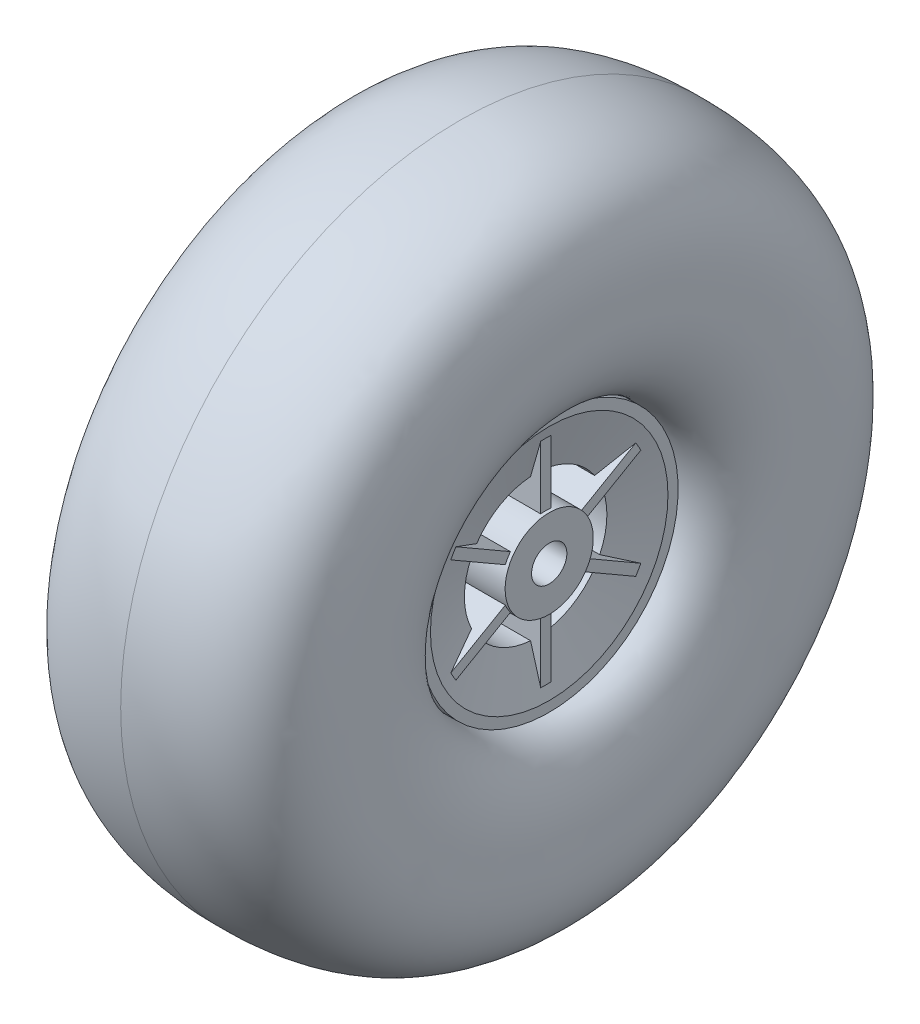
from build123d import *

# Parameters (mm, degrees)
BOSS_EXTRU_1_REACH           = 39.251
ESQUISSE2_W                  = 1.5
ESQUISSE2_H                  = 11.043414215
R_P_TITION_CIRCULAIRE1_COUNT = 6
SYM_TRIE1_COPY_1_REACH       = 39.251
SYM_TRIE1_COPY_1_SKETCH_W    = 1.5
SYM_TRIE1_COPY_1_SKETCH_H    = 11.043414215
SYM_TRIE1_COPY_2_REACH       = 39.251
SYM_TRIE1_COPY_2_SKETCH_W    = 1.5
SYM_TRIE1_COPY_2_SKETCH_H    = 11.043414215
SYM_TRIE1_COPY_3_REACH       = 39.251
SYM_TRIE1_COPY_3_SKETCH_W    = 1.5
SYM_TRIE1_COPY_3_SKETCH_H    = 11.043414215
SYM_TRIE1_COPY_4_REACH       = 39.251
SYM_TRIE1_COPY_4_SKETCH_W    = 1.5
SYM_TRIE1_COPY_4_SKETCH_H    = 11.043414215
SYM_TRIE1_COPY_5_REACH       = 39.251
SYM_TRIE1_COPY_5_SKETCH_W    = 1.5
SYM_TRIE1_COPY_5_SKETCH_H    = 11.043414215


with BuildPart() as part:
    # Esquisse1 → R_volution1 (revolve)
    with BuildSketch(Plane.XY, mode=Mode.PRIVATE) as r_volution1_sk:
        Polygon((13.15, 19), (13.15, 17.5), (11.15, 10.5), (4.15, 10.5), (4.15, 6.5), (13.15, 6.5), (13.15, 2.6), (-13.15, 2.6), (-13.15, 6.5), (-4.15, 6.5), (-4.15, 10.5), (-11.15, 10.5), (-13.15, 17.5), (-13.15, 19), (-11.15, 19), (-11.15, 17.780109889), (-9.641397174, 12.5), (9.641397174, 12.5), (11.15, 17.780109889), (11.15, 19), align=None)
    revolve(r_volution1_sk.sketch.rotate(Axis((0, 0, 0), (1, 0, 0)), 90), axis=Axis((0, 0, 0), (1, 0, 0)))

    # Esquisse2 → Boss.-Extru.1 (add, up to next)
    with BuildSketch(Plane(origin=(12.65, 0, 0), x_dir=(0, 0, -1), z_dir=(1, 0, 0)), mode=Mode.PRIVATE) as boss_extru_1_sk1:
        with Locations((0, 11.978292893)):
            Rectangle(ESQUISSE2_W, ESQUISSE2_H)
    boss_extru_1_tool1 = extrude(boss_extru_1_sk1.sketch, amount=-BOSS_EXTRU_1_REACH, mode=Mode.PRIVATE) - part.part
    boss_extru_1 = boss_extru_1_tool1.solids().sort_by_distance((12.65, 11.978293, 0))[0]
    add(boss_extru_1)

    # R_p_tition circulaire1: Boss.-Extru.1 ×6 about axis
    r_p_tition_circulaire1_axis = Axis((0, 0, 0), (1, 0, 0))
    for i in range(1, R_P_TITION_CIRCULAIRE1_COUNT):
        add(boss_extru_1.rotate(r_p_tition_circulaire1_axis, i * 360 / R_P_TITION_CIRCULAIRE1_COUNT))

    # Esquisse3 → R_volution2 (revolve)
    with BuildSketch(Plane.XY, mode=Mode.PRIVATE) as r_volution2_sk:
        with BuildLine():
            Line((11.15, 19), (11.15, 17.780109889))
            Line((11.15, 17.780109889), (9.641397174, 12.5))
            Line((9.641397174, 12.5), (-9.641397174, 12.5))
            Line((-9.641397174, 12.5), (-11.15, 17.780109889))
            Line((-11.15, 17.780109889), (-11.15, 19))
            add(Edge.make_bspline(
                [(0, 50), (-19.38966971, 50), (-18.920836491, 35.647426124), (-19.144746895, 24.346670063), (-15.928984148, 19), (-11.15, 19)],
                knots=[0, 0, 0, 0, 0.32423674, 0.42423674, 1, 1, 1, 1], degree=3))
            add(Edge.make_bspline(
                [(0, 50), (19.38966971, 50), (18.920836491, 35.647426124), (19.144746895, 24.346670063), (15.928984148, 19), (11.15, 19)],
                knots=[0, 0, 0, 0, 0.32423674, 0.42423674, 1, 1, 1, 1], degree=3))
        make_face()
    revolve(r_volution2_sk.sketch.rotate(Axis((0, 0, 0), (1, 0, 0)), 295.903956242), axis=Axis((0, 0, 0), (1, 0, 0)))

    # Sym_trie1: Boss.-Extru.1 across plane
    add(boss_extru_1.mirror(Plane(origin=(0, 0, 0), x_dir=(0, 0, 1), z_dir=(1, 0, 0))))

    # Sym_trie1 copy 1 sketch → Sym_trie1 copy 1 (add, up to next)
    with BuildSketch(Plane(origin=(-12.65, 0, 0), x_dir=(0, 0.8660254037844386, -0.5000000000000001), z_dir=(-1, 0, 0)), mode=Mode.PRIVATE) as sym_trie1_copy_1_sk1:
        with Locations((0, -11.978292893)):
            Rectangle(SYM_TRIE1_COPY_1_SKETCH_W, SYM_TRIE1_COPY_1_SKETCH_H)
    sym_trie1_copy_1_tool1 = extrude(sym_trie1_copy_1_sk1.sketch, amount=-SYM_TRIE1_COPY_1_REACH, mode=Mode.PRIVATE) - part.part
    add(sym_trie1_copy_1_tool1.solids().sort_by_distance((-12.65, 5.9891465, 10.373506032))[0])

    # Sym_trie1 copy 2 sketch → Sym_trie1 copy 2 (add, up to next)
    with BuildSketch(Plane(origin=(-12.65, 0, 0), x_dir=(0, 0.8660254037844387, 0.4999999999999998), z_dir=(-1, 0, 0)), mode=Mode.PRIVATE) as sym_trie1_copy_2_sk1:
        with Locations((0, -11.978292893)):
            Rectangle(SYM_TRIE1_COPY_2_SKETCH_W, SYM_TRIE1_COPY_2_SKETCH_H)
    sym_trie1_copy_2_tool1 = extrude(sym_trie1_copy_2_sk1.sketch, amount=-SYM_TRIE1_COPY_2_REACH, mode=Mode.PRIVATE) - part.part
    add(sym_trie1_copy_2_tool1.solids().sort_by_distance((-12.65, -5.9891465, 10.373506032))[0])

    # Sym_trie1 copy 3 sketch → Sym_trie1 copy 3 (add, up to next)
    with BuildSketch(Plane.ZY.offset(12.65), mode=Mode.PRIVATE) as sym_trie1_copy_3_sk1:
        with Locations((0, -11.978292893)):
            Rectangle(SYM_TRIE1_COPY_3_SKETCH_W, SYM_TRIE1_COPY_3_SKETCH_H)
    sym_trie1_copy_3_tool1 = extrude(sym_trie1_copy_3_sk1.sketch, amount=-SYM_TRIE1_COPY_3_REACH, mode=Mode.PRIVATE) - part.part
    add(sym_trie1_copy_3_tool1.solids().sort_by_distance((-12.65, -11.978293, 0))[0])

    # Sym_trie1 copy 4 sketch → Sym_trie1 copy 4 (add, up to next)
    with BuildSketch(Plane(origin=(-12.65, 0, 0), x_dir=(0, -0.8660254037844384, 0.5000000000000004), z_dir=(-1, 0, 0)), mode=Mode.PRIVATE) as sym_trie1_copy_4_sk1:
        with Locations((0, -11.978292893)):
            Rectangle(SYM_TRIE1_COPY_4_SKETCH_W, SYM_TRIE1_COPY_4_SKETCH_H)
    sym_trie1_copy_4_tool1 = extrude(sym_trie1_copy_4_sk1.sketch, amount=-SYM_TRIE1_COPY_4_REACH, mode=Mode.PRIVATE) - part.part
    add(sym_trie1_copy_4_tool1.solids().sort_by_distance((-12.65, -5.9891465, -10.373506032))[0])

    # Sym_trie1 copy 5 sketch → Sym_trie1 copy 5 (add, up to next)
    with BuildSketch(Plane(origin=(-12.65, 0, 0), x_dir=(0, -0.8660254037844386, -0.5000000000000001), z_dir=(-1, 0, 0)), mode=Mode.PRIVATE) as sym_trie1_copy_5_sk1:
        with Locations((0, -11.978292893)):
            Rectangle(SYM_TRIE1_COPY_5_SKETCH_W, SYM_TRIE1_COPY_5_SKETCH_H)
    sym_trie1_copy_5_tool1 = extrude(sym_trie1_copy_5_sk1.sketch, amount=-SYM_TRIE1_COPY_5_REACH, mode=Mode.PRIVATE) - part.part
    add(sym_trie1_copy_5_tool1.solids().sort_by_distance((-12.65, 5.9891465, -10.373506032))[0])


solid = part.part
